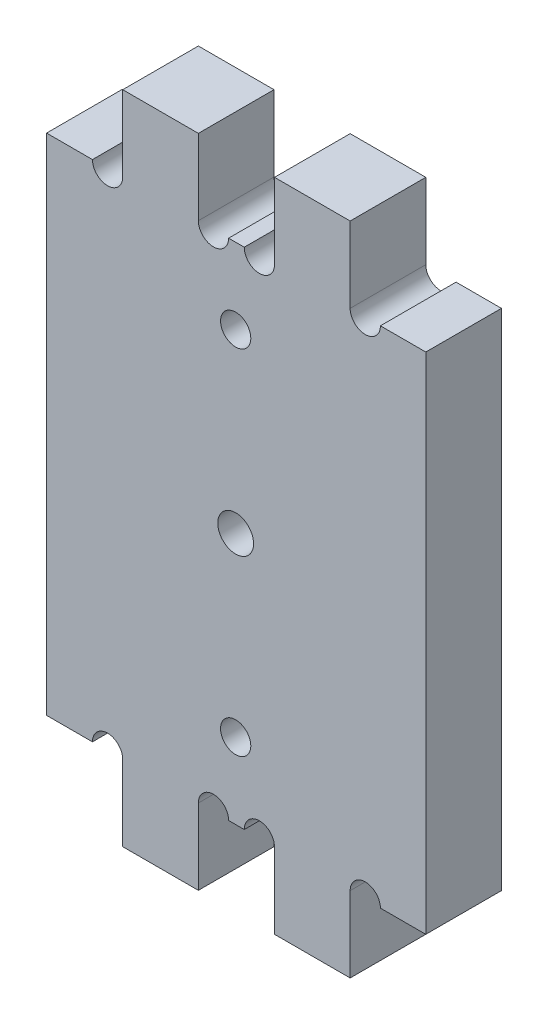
ISO-10303-21;
HEADER;
FILE_DESCRIPTION(('STEP AP214'),'2;1');
FILE_NAME('part.step','',(''),(''),'','','');
FILE_SCHEMA(('AUTOMOTIVE_DESIGN { 1 0 10303 214 1 1 1 1 }'));
ENDSEC;
DATA;
#1=APPLICATION_CONTEXT('core data for automotive mechanical design processes');
#2=APPLICATION_PROTOCOL_DEFINITION('international standard','automotive_design',2000,#1);
#3=PRODUCT_CONTEXT('',#1,'mechanical');
#4=PRODUCT('Part','Part','',(#3));
#5=PRODUCT_RELATED_PRODUCT_CATEGORY('part','',(#4));
#6=PRODUCT_DEFINITION_FORMATION('','',#4);
#7=PRODUCT_DEFINITION_CONTEXT('part definition',#1,'design');
#8=PRODUCT_DEFINITION('design','',#6,#7);
#9=PRODUCT_DEFINITION_SHAPE('','',#8);
#10=(LENGTH_UNIT() NAMED_UNIT(*) SI_UNIT(.MILLI.,.METRE.));
#11=(NAMED_UNIT(*) PLANE_ANGLE_UNIT() SI_UNIT($,.RADIAN.));
#12=(NAMED_UNIT(*) SI_UNIT($,.STERADIAN.) SOLID_ANGLE_UNIT());
#13=UNCERTAINTY_MEASURE_WITH_UNIT(LENGTH_MEASURE(1.E-05),#10,'distance_accuracy_value','');
#14=(GEOMETRIC_REPRESENTATION_CONTEXT(3) GLOBAL_UNCERTAINTY_ASSIGNED_CONTEXT((#13)) GLOBAL_UNIT_ASSIGNED_CONTEXT((#10,
#11,#12)) REPRESENTATION_CONTEXT('',''));
#15=CARTESIAN_POINT('',(0.,0.,0.));
#16=DIRECTION('',(0.,0.,1.));
#17=DIRECTION('',(1.,0.,0.));
#18=AXIS2_PLACEMENT_3D('',#15,#16,#17);
#19=CARTESIAN_POINT('',(0.,0.,15.));
#20=DIRECTION('',(0.,1.,0.));
#21=DIRECTION('',(-1.,0.,0.));
#22=AXIS2_PLACEMENT_3D('',#19,#20,#21);
#23=PLANE('',#22);
#24=DIRECTION('',(1.,0.,0.));
#25=VECTOR('',#24,1.);
#26=CARTESIAN_POINT('',(0.,0.,0.));
#27=LINE('',#26,#25);
#28=CARTESIAN_POINT('',(-8.99999999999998,0.,0.));
#29=VERTEX_POINT('',#28);
#30=CARTESIAN_POINT('',(0.,0.,0.));
#31=VERTEX_POINT('',#30);
#32=EDGE_CURVE('E255',#29,#31,#27,.T.);
#33=ORIENTED_EDGE('',*,*,#32,.T.);
#34=DIRECTION('',(0.,0.,-1.));
#35=VECTOR('',#34,1.);
#36=CARTESIAN_POINT('',(0.,0.,15.));
#37=LINE('',#36,#35);
#38=CARTESIAN_POINT('',(0.,0.,15.));
#39=VERTEX_POINT('',#38);
#40=EDGE_CURVE('E11',#39,#31,#37,.T.);
#41=ORIENTED_EDGE('',*,*,#40,.F.);
#42=DIRECTION('',(1.,0.,0.));
#43=VECTOR('',#42,1.);
#44=CARTESIAN_POINT('',(0.,0.,15.));
#45=LINE('',#44,#43);
#46=CARTESIAN_POINT('',(-8.99999999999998,0.,15.));
#47=VERTEX_POINT('',#46);
#48=EDGE_CURVE('E310',#47,#39,#45,.T.);
#49=ORIENTED_EDGE('',*,*,#48,.F.);
#50=DIRECTION('',(0.,0.,-1.));
#51=VECTOR('',#50,1.);
#52=CARTESIAN_POINT('',(-8.99999999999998,0.,15.));
#53=LINE('',#52,#51);
#54=EDGE_CURVE('E251',#47,#29,#53,.T.);
#55=ORIENTED_EDGE('',*,*,#54,.T.);
#56=EDGE_LOOP('',(#33,#41,#49,#55));
#57=FACE_BOUND('',#56,.T.);
#58=ADVANCED_FACE('F37',(#57),#23,.F.);
#59=CARTESIAN_POINT('',(0.,0.,15.));
#60=DIRECTION('',(-1.,0.,0.));
#61=DIRECTION('',(0.,0.,1.));
#62=AXIS2_PLACEMENT_3D('',#59,#60,#61);
#63=PLANE('',#62);
#64=DIRECTION('',(0.,1.,0.));
#65=VECTOR('',#64,1.);
#66=CARTESIAN_POINT('',(0.,0.,0.));
#67=LINE('',#66,#65);
#68=CARTESIAN_POINT('',(0.,100.,0.));
#69=VERTEX_POINT('',#68);
#70=EDGE_CURVE('E258',#31,#69,#67,.T.);
#71=ORIENTED_EDGE('',*,*,#70,.T.);
#72=DIRECTION('',(0.,0.,-1.));
#73=VECTOR('',#72,1.);
#74=CARTESIAN_POINT('',(0.,100.,15.));
#75=LINE('',#74,#73);
#76=CARTESIAN_POINT('',(0.,100.,15.));
#77=VERTEX_POINT('',#76);
#78=EDGE_CURVE('E46',#77,#69,#75,.T.);
#79=ORIENTED_EDGE('',*,*,#78,.F.);
#80=DIRECTION('',(0.,1.,0.));
#81=VECTOR('',#80,1.);
#82=CARTESIAN_POINT('',(0.,0.,15.));
#83=LINE('',#82,#81);
#84=EDGE_CURVE('E158',#39,#77,#83,.T.);
#85=ORIENTED_EDGE('',*,*,#84,.F.);
#86=ORIENTED_EDGE('',*,*,#40,.T.);
#87=EDGE_LOOP('',(#71,#79,#85,#86));
#88=FACE_BOUND('',#87,.T.);
#89=ADVANCED_FACE('F486',(#88),#63,.F.);
#90=CARTESIAN_POINT('',(0.,100.,15.));
#91=DIRECTION('',(0.,-1.,0.));
#92=DIRECTION('',(0.,0.,-1.));
#93=AXIS2_PLACEMENT_3D('',#90,#91,#92);
#94=PLANE('',#93);
#95=DIRECTION('',(-1.,0.,0.));
#96=VECTOR('',#95,1.);
#97=CARTESIAN_POINT('',(0.,100.,0.));
#98=LINE('',#97,#96);
#99=CARTESIAN_POINT('',(-9.,100.,0.));
#100=VERTEX_POINT('',#99);
#101=EDGE_CURVE('E261',#69,#100,#98,.T.);
#102=ORIENTED_EDGE('',*,*,#101,.T.);
#103=DIRECTION('',(0.,0.,-1.));
#104=VECTOR('',#103,1.);
#105=CARTESIAN_POINT('',(-9.,100.,15.));
#106=LINE('',#105,#104);
#107=CARTESIAN_POINT('',(-9.,100.,15.));
#108=VERTEX_POINT('',#107);
#109=EDGE_CURVE('E377',#108,#100,#106,.T.);
#110=ORIENTED_EDGE('',*,*,#109,.F.);
#111=DIRECTION('',(-1.,0.,0.));
#112=VECTOR('',#111,1.);
#113=CARTESIAN_POINT('',(0.,100.,15.));
#114=LINE('',#113,#112);
#115=EDGE_CURVE('E414',#77,#108,#114,.T.);
#116=ORIENTED_EDGE('',*,*,#115,.F.);
#117=ORIENTED_EDGE('',*,*,#78,.T.);
#118=EDGE_LOOP('',(#102,#110,#116,#117));
#119=FACE_BOUND('',#118,.T.);
#120=ADVANCED_FACE('F490',(#119),#94,.F.);
#121=CARTESIAN_POINT('',(-12.,100.,15.));
#122=DIRECTION('',(0.,0.,-1.));
#123=DIRECTION('',(-1.,0.,0.));
#124=AXIS2_PLACEMENT_3D('',#121,#122,#123);
#125=CYLINDRICAL_SURFACE('',#124,3.);
#126=CARTESIAN_POINT('',(-12.,100.,0.));
#127=DIRECTION('',(0.,0.,-1.));
#128=DIRECTION('',(-1.,0.,0.));
#129=AXIS2_PLACEMENT_3D('',#126,#127,#128);
#130=CIRCLE('',#129,3.);
#131=CARTESIAN_POINT('',(-15.,100.,0.));
#132=VERTEX_POINT('',#131);
#133=EDGE_CURVE('E263',#100,#132,#130,.T.);
#134=ORIENTED_EDGE('',*,*,#133,.T.);
#135=DIRECTION('',(0.,0.,-1.));
#136=VECTOR('',#135,1.);
#137=CARTESIAN_POINT('',(-15.,100.,15.));
#138=LINE('',#137,#136);
#139=CARTESIAN_POINT('',(-15.,100.,15.));
#140=VERTEX_POINT('',#139);
#141=EDGE_CURVE('E374',#140,#132,#138,.T.);
#142=ORIENTED_EDGE('',*,*,#141,.F.);
#143=CARTESIAN_POINT('',(-12.,100.,15.));
#144=DIRECTION('',(0.,0.,-1.));
#145=DIRECTION('',(-1.,0.,0.));
#146=AXIS2_PLACEMENT_3D('',#143,#144,#145);
#147=CIRCLE('',#146,3.);
#148=EDGE_CURVE('E416',#108,#140,#147,.T.);
#149=ORIENTED_EDGE('',*,*,#148,.F.);
#150=ORIENTED_EDGE('',*,*,#109,.T.);
#151=EDGE_LOOP('',(#134,#142,#149,#150));
#152=FACE_BOUND('',#151,.T.);
#153=ADVANCED_FACE('F494',(#152),#125,.F.);
#154=CARTESIAN_POINT('',(-15.,100.,15.));
#155=DIRECTION('',(-1.,0.,0.));
#156=DIRECTION('',(0.,-1.,0.));
#157=AXIS2_PLACEMENT_3D('',#154,#155,#156);
#158=PLANE('',#157);
#159=DIRECTION('',(0.,1.,0.));
#160=VECTOR('',#159,1.);
#161=CARTESIAN_POINT('',(-15.,100.,0.));
#162=LINE('',#161,#160);
#163=CARTESIAN_POINT('',(-15.,115.,0.));
#164=VERTEX_POINT('',#163);
#165=EDGE_CURVE('E265',#132,#164,#162,.T.);
#166=ORIENTED_EDGE('',*,*,#165,.T.);
#167=DIRECTION('',(0.,0.,-1.));
#168=VECTOR('',#167,1.);
#169=CARTESIAN_POINT('',(-15.,115.,15.));
#170=LINE('',#169,#168);
#171=CARTESIAN_POINT('',(-15.,115.,15.));
#172=VERTEX_POINT('',#171);
#173=EDGE_CURVE('E371',#172,#164,#170,.T.);
#174=ORIENTED_EDGE('',*,*,#173,.F.);
#175=DIRECTION('',(0.,1.,0.));
#176=VECTOR('',#175,1.);
#177=CARTESIAN_POINT('',(-15.,100.,15.));
#178=LINE('',#177,#176);
#179=EDGE_CURVE('E418',#140,#172,#178,.T.);
#180=ORIENTED_EDGE('',*,*,#179,.F.);
#181=ORIENTED_EDGE('',*,*,#141,.T.);
#182=EDGE_LOOP('',(#166,#174,#180,#181));
#183=FACE_BOUND('',#182,.T.);
#184=ADVANCED_FACE('F500',(#183),#158,.F.);
#185=CARTESIAN_POINT('',(-15.,115.,15.));
#186=DIRECTION('',(0.,-1.,0.));
#187=DIRECTION('',(0.,0.,-1.));
#188=AXIS2_PLACEMENT_3D('',#185,#186,#187);
#189=PLANE('',#188);
#190=DIRECTION('',(-1.,0.,0.));
#191=VECTOR('',#190,1.);
#192=CARTESIAN_POINT('',(-15.,115.,0.));
#193=LINE('',#192,#191);
#194=CARTESIAN_POINT('',(-30.,115.,0.));
#195=VERTEX_POINT('',#194);
#196=EDGE_CURVE('E267',#164,#195,#193,.T.);
#197=ORIENTED_EDGE('',*,*,#196,.T.);
#198=DIRECTION('',(0.,0.,-1.));
#199=VECTOR('',#198,1.);
#200=CARTESIAN_POINT('',(-30.,115.,15.));
#201=LINE('',#200,#199);
#202=CARTESIAN_POINT('',(-30.,115.,15.));
#203=VERTEX_POINT('',#202);
#204=EDGE_CURVE('E368',#203,#195,#201,.T.);
#205=ORIENTED_EDGE('',*,*,#204,.F.);
#206=DIRECTION('',(-1.,0.,0.));
#207=VECTOR('',#206,1.);
#208=CARTESIAN_POINT('',(-15.,115.,15.));
#209=LINE('',#208,#207);
#210=EDGE_CURVE('E420',#172,#203,#209,.T.);
#211=ORIENTED_EDGE('',*,*,#210,.F.);
#212=ORIENTED_EDGE('',*,*,#173,.T.);
#213=EDGE_LOOP('',(#197,#205,#211,#212));
#214=FACE_BOUND('',#213,.T.);
#215=ADVANCED_FACE('F504',(#214),#189,.F.);
#216=CARTESIAN_POINT('',(-30.,115.,15.));
#217=DIRECTION('',(1.,0.,0.));
#218=DIRECTION('',(0.,1.,0.));
#219=AXIS2_PLACEMENT_3D('',#216,#217,#218);
#220=PLANE('',#219);
#221=DIRECTION('',(0.,-1.,0.));
#222=VECTOR('',#221,1.);
#223=CARTESIAN_POINT('',(-30.,115.,0.));
#224=LINE('',#223,#222);
#225=CARTESIAN_POINT('',(-30.,100.,0.));
#226=VERTEX_POINT('',#225);
#227=EDGE_CURVE('E269',#195,#226,#224,.T.);
#228=ORIENTED_EDGE('',*,*,#227,.T.);
#229=DIRECTION('',(0.,0.,-1.));
#230=VECTOR('',#229,1.);
#231=CARTESIAN_POINT('',(-30.,100.,15.));
#232=LINE('',#231,#230);
#233=CARTESIAN_POINT('',(-30.,100.,15.));
#234=VERTEX_POINT('',#233);
#235=EDGE_CURVE('E365',#234,#226,#232,.T.);
#236=ORIENTED_EDGE('',*,*,#235,.F.);
#237=DIRECTION('',(0.,-1.,0.));
#238=VECTOR('',#237,1.);
#239=CARTESIAN_POINT('',(-30.,115.,15.));
#240=LINE('',#239,#238);
#241=EDGE_CURVE('E422',#203,#234,#240,.T.);
#242=ORIENTED_EDGE('',*,*,#241,.F.);
#243=ORIENTED_EDGE('',*,*,#204,.T.);
#244=EDGE_LOOP('',(#228,#236,#242,#243));
#245=FACE_BOUND('',#244,.T.);
#246=ADVANCED_FACE('F508',(#245),#220,.F.);
#247=CARTESIAN_POINT('',(-33.,100.,15.));
#248=DIRECTION('',(0.,0.,-1.));
#249=DIRECTION('',(-1.,0.,0.));
#250=AXIS2_PLACEMENT_3D('',#247,#248,#249);
#251=CYLINDRICAL_SURFACE('',#250,3.);
#252=CARTESIAN_POINT('',(-33.,100.,0.));
#253=DIRECTION('',(0.,0.,-1.));
#254=DIRECTION('',(-1.,0.,0.));
#255=AXIS2_PLACEMENT_3D('',#252,#253,#254);
#256=CIRCLE('',#255,3.);
#257=CARTESIAN_POINT('',(-36.,100.,0.));
#258=VERTEX_POINT('',#257);
#259=EDGE_CURVE('E271',#226,#258,#256,.T.);
#260=ORIENTED_EDGE('',*,*,#259,.T.);
#261=DIRECTION('',(0.,0.,-1.));
#262=VECTOR('',#261,1.);
#263=CARTESIAN_POINT('',(-36.,100.,15.));
#264=LINE('',#263,#262);
#265=CARTESIAN_POINT('',(-36.,100.,15.));
#266=VERTEX_POINT('',#265);
#267=EDGE_CURVE('E362',#266,#258,#264,.T.);
#268=ORIENTED_EDGE('',*,*,#267,.F.);
#269=CARTESIAN_POINT('',(-33.,100.,15.));
#270=DIRECTION('',(0.,0.,-1.));
#271=DIRECTION('',(-1.,0.,0.));
#272=AXIS2_PLACEMENT_3D('',#269,#270,#271);
#273=CIRCLE('',#272,3.);
#274=EDGE_CURVE('E424',#234,#266,#273,.T.);
#275=ORIENTED_EDGE('',*,*,#274,.F.);
#276=ORIENTED_EDGE('',*,*,#235,.T.);
#277=EDGE_LOOP('',(#260,#268,#275,#276));
#278=FACE_BOUND('',#277,.T.);
#279=ADVANCED_FACE('F512',(#278),#251,.F.);
#280=CARTESIAN_POINT('',(-36.,100.,15.));
#281=DIRECTION('',(0.,-1.,0.));
#282=DIRECTION('',(0.,0.,-1.));
#283=AXIS2_PLACEMENT_3D('',#280,#281,#282);
#284=PLANE('',#283);
#285=DIRECTION('',(-1.,0.,0.));
#286=VECTOR('',#285,1.);
#287=CARTESIAN_POINT('',(-36.,100.,0.));
#288=LINE('',#287,#286);
#289=CARTESIAN_POINT('',(-39.1,100.,0.));
#290=VERTEX_POINT('',#289);
#291=EDGE_CURVE('E273',#258,#290,#288,.T.);
#292=ORIENTED_EDGE('',*,*,#291,.T.);
#293=DIRECTION('',(0.,0.,-1.));
#294=VECTOR('',#293,1.);
#295=CARTESIAN_POINT('',(-39.1,100.,15.));
#296=LINE('',#295,#294);
#297=CARTESIAN_POINT('',(-39.1,100.,15.));
#298=VERTEX_POINT('',#297);
#299=EDGE_CURVE('E359',#298,#290,#296,.T.);
#300=ORIENTED_EDGE('',*,*,#299,.F.);
#301=DIRECTION('',(-1.,0.,0.));
#302=VECTOR('',#301,1.);
#303=CARTESIAN_POINT('',(-36.,100.,15.));
#304=LINE('',#303,#302);
#305=EDGE_CURVE('E426',#266,#298,#304,.T.);
#306=ORIENTED_EDGE('',*,*,#305,.F.);
#307=ORIENTED_EDGE('',*,*,#267,.T.);
#308=EDGE_LOOP('',(#292,#300,#306,#307));
#309=FACE_BOUND('',#308,.T.);
#310=ADVANCED_FACE('F516',(#309),#284,.F.);
#311=CARTESIAN_POINT('',(-42.1,100.,15.));
#312=DIRECTION('',(0.,0.,-1.));
#313=DIRECTION('',(-1.,0.,0.));
#314=AXIS2_PLACEMENT_3D('',#311,#312,#313);
#315=CYLINDRICAL_SURFACE('',#314,2.99999999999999);
#316=CARTESIAN_POINT('',(-42.1,100.,0.));
#317=DIRECTION('',(0.,0.,-1.));
#318=DIRECTION('',(-1.,0.,0.));
#319=AXIS2_PLACEMENT_3D('',#316,#317,#318);
#320=CIRCLE('',#319,2.99999999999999);
#321=CARTESIAN_POINT('',(-45.1,100.,0.));
#322=VERTEX_POINT('',#321);
#323=EDGE_CURVE('E275',#290,#322,#320,.T.);
#324=ORIENTED_EDGE('',*,*,#323,.T.);
#325=DIRECTION('',(0.,0.,-1.));
#326=VECTOR('',#325,1.);
#327=CARTESIAN_POINT('',(-45.1,100.,15.));
#328=LINE('',#327,#326);
#329=CARTESIAN_POINT('',(-45.1,100.,15.));
#330=VERTEX_POINT('',#329);
#331=EDGE_CURVE('E356',#330,#322,#328,.T.);
#332=ORIENTED_EDGE('',*,*,#331,.F.);
#333=CARTESIAN_POINT('',(-42.1,100.,15.));
#334=DIRECTION('',(0.,0.,-1.));
#335=DIRECTION('',(-1.,0.,0.));
#336=AXIS2_PLACEMENT_3D('',#333,#334,#335);
#337=CIRCLE('',#336,2.99999999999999);
#338=EDGE_CURVE('E428',#298,#330,#337,.T.);
#339=ORIENTED_EDGE('',*,*,#338,.F.);
#340=ORIENTED_EDGE('',*,*,#299,.T.);
#341=EDGE_LOOP('',(#324,#332,#339,#340));
#342=FACE_BOUND('',#341,.T.);
#343=ADVANCED_FACE('F520',(#342),#315,.F.);
#344=CARTESIAN_POINT('',(-45.1,100.,15.));
#345=DIRECTION('',(-1.,0.,0.));
#346=DIRECTION('',(0.,-1.,0.));
#347=AXIS2_PLACEMENT_3D('',#344,#345,#346);
#348=PLANE('',#347);
#349=DIRECTION('',(0.,1.,0.));
#350=VECTOR('',#349,1.);
#351=CARTESIAN_POINT('',(-45.1,100.,0.));
#352=LINE('',#351,#350);
#353=CARTESIAN_POINT('',(-45.1,115.,0.));
#354=VERTEX_POINT('',#353);
#355=EDGE_CURVE('E277',#322,#354,#352,.T.);
#356=ORIENTED_EDGE('',*,*,#355,.T.);
#357=DIRECTION('',(0.,0.,-1.));
#358=VECTOR('',#357,1.);
#359=CARTESIAN_POINT('',(-45.1,115.,15.));
#360=LINE('',#359,#358);
#361=CARTESIAN_POINT('',(-45.1,115.,15.));
#362=VERTEX_POINT('',#361);
#363=EDGE_CURVE('E353',#362,#354,#360,.T.);
#364=ORIENTED_EDGE('',*,*,#363,.F.);
#365=DIRECTION('',(0.,1.,0.));
#366=VECTOR('',#365,1.);
#367=CARTESIAN_POINT('',(-45.1,100.,15.));
#368=LINE('',#367,#366);
#369=EDGE_CURVE('E430',#330,#362,#368,.T.);
#370=ORIENTED_EDGE('',*,*,#369,.F.);
#371=ORIENTED_EDGE('',*,*,#331,.T.);
#372=EDGE_LOOP('',(#356,#364,#370,#371));
#373=FACE_BOUND('',#372,.T.);
#374=ADVANCED_FACE('F524',(#373),#348,.F.);
#375=CARTESIAN_POINT('',(-45.1,115.,15.));
#376=DIRECTION('',(0.,-1.,0.));
#377=DIRECTION('',(0.,0.,-1.));
#378=AXIS2_PLACEMENT_3D('',#375,#376,#377);
#379=PLANE('',#378);
#380=DIRECTION('',(-1.,0.,0.));
#381=VECTOR('',#380,1.);
#382=CARTESIAN_POINT('',(-45.1,115.,0.));
#383=LINE('',#382,#381);
#384=CARTESIAN_POINT('',(-60.1,115.,0.));
#385=VERTEX_POINT('',#384);
#386=EDGE_CURVE('E279',#354,#385,#383,.T.);
#387=ORIENTED_EDGE('',*,*,#386,.T.);
#388=DIRECTION('',(0.,0.,-1.));
#389=VECTOR('',#388,1.);
#390=CARTESIAN_POINT('',(-60.1,115.,15.));
#391=LINE('',#390,#389);
#392=CARTESIAN_POINT('',(-60.1,115.,15.));
#393=VERTEX_POINT('',#392);
#394=EDGE_CURVE('E350',#393,#385,#391,.T.);
#395=ORIENTED_EDGE('',*,*,#394,.F.);
#396=DIRECTION('',(-1.,0.,0.));
#397=VECTOR('',#396,1.);
#398=CARTESIAN_POINT('',(-45.1,115.,15.));
#399=LINE('',#398,#397);
#400=EDGE_CURVE('E432',#362,#393,#399,.T.);
#401=ORIENTED_EDGE('',*,*,#400,.F.);
#402=ORIENTED_EDGE('',*,*,#363,.T.);
#403=EDGE_LOOP('',(#387,#395,#401,#402));
#404=FACE_BOUND('',#403,.T.);
#405=ADVANCED_FACE('F528',(#404),#379,.F.);
#406=CARTESIAN_POINT('',(-60.1,115.,15.));
#407=DIRECTION('',(1.,0.,0.));
#408=DIRECTION('',(0.,1.,0.));
#409=AXIS2_PLACEMENT_3D('',#406,#407,#408);
#410=PLANE('',#409);
#411=DIRECTION('',(0.,-1.,0.));
#412=VECTOR('',#411,1.);
#413=CARTESIAN_POINT('',(-60.1,115.,0.));
#414=LINE('',#413,#412);
#415=CARTESIAN_POINT('',(-60.1,100.,0.));
#416=VERTEX_POINT('',#415);
#417=EDGE_CURVE('E281',#385,#416,#414,.T.);
#418=ORIENTED_EDGE('',*,*,#417,.T.);
#419=DIRECTION('',(0.,0.,-1.));
#420=VECTOR('',#419,1.);
#421=CARTESIAN_POINT('',(-60.1,100.,15.));
#422=LINE('',#421,#420);
#423=CARTESIAN_POINT('',(-60.1,100.,15.));
#424=VERTEX_POINT('',#423);
#425=EDGE_CURVE('E347',#424,#416,#422,.T.);
#426=ORIENTED_EDGE('',*,*,#425,.F.);
#427=DIRECTION('',(0.,-1.,0.));
#428=VECTOR('',#427,1.);
#429=CARTESIAN_POINT('',(-60.1,115.,15.));
#430=LINE('',#429,#428);
#431=EDGE_CURVE('E434',#393,#424,#430,.T.);
#432=ORIENTED_EDGE('',*,*,#431,.F.);
#433=ORIENTED_EDGE('',*,*,#394,.T.);
#434=EDGE_LOOP('',(#418,#426,#432,#433));
#435=FACE_BOUND('',#434,.T.);
#436=ADVANCED_FACE('F532',(#435),#410,.F.);
#437=CARTESIAN_POINT('',(-63.1,100.,15.));
#438=DIRECTION('',(0.,0.,-1.));
#439=DIRECTION('',(-1.,0.,0.));
#440=AXIS2_PLACEMENT_3D('',#437,#438,#439);
#441=CYLINDRICAL_SURFACE('',#440,3.);
#442=CARTESIAN_POINT('',(-63.1,100.,0.));
#443=DIRECTION('',(0.,0.,-1.));
#444=DIRECTION('',(-1.,0.,0.));
#445=AXIS2_PLACEMENT_3D('',#442,#443,#444);
#446=CIRCLE('',#445,3.);
#447=CARTESIAN_POINT('',(-66.1,100.,0.));
#448=VERTEX_POINT('',#447);
#449=EDGE_CURVE('E283',#416,#448,#446,.T.);
#450=ORIENTED_EDGE('',*,*,#449,.T.);
#451=DIRECTION('',(0.,0.,-1.));
#452=VECTOR('',#451,1.);
#453=CARTESIAN_POINT('',(-66.1,100.,15.));
#454=LINE('',#453,#452);
#455=CARTESIAN_POINT('',(-66.1,100.,15.));
#456=VERTEX_POINT('',#455);
#457=EDGE_CURVE('E344',#456,#448,#454,.T.);
#458=ORIENTED_EDGE('',*,*,#457,.F.);
#459=CARTESIAN_POINT('',(-63.1,100.,15.));
#460=DIRECTION('',(0.,0.,-1.));
#461=DIRECTION('',(-1.,0.,0.));
#462=AXIS2_PLACEMENT_3D('',#459,#460,#461);
#463=CIRCLE('',#462,3.);
#464=EDGE_CURVE('E436',#424,#456,#463,.T.);
#465=ORIENTED_EDGE('',*,*,#464,.F.);
#466=ORIENTED_EDGE('',*,*,#425,.T.);
#467=EDGE_LOOP('',(#450,#458,#465,#466));
#468=FACE_BOUND('',#467,.T.);
#469=ADVANCED_FACE('F536',(#468),#441,.F.);
#470=CARTESIAN_POINT('',(-66.1,100.,15.));
#471=DIRECTION('',(0.,-1.,0.));
#472=DIRECTION('',(1.,0.,0.));
#473=AXIS2_PLACEMENT_3D('',#470,#471,#472);
#474=PLANE('',#473);
#475=DIRECTION('',(-1.,0.,0.));
#476=VECTOR('',#475,1.);
#477=CARTESIAN_POINT('',(-66.1,100.,0.));
#478=LINE('',#477,#476);
#479=CARTESIAN_POINT('',(-75.2,100.,0.));
#480=VERTEX_POINT('',#479);
#481=EDGE_CURVE('E285',#448,#480,#478,.T.);
#482=ORIENTED_EDGE('',*,*,#481,.T.);
#483=DIRECTION('',(0.,0.,-1.));
#484=VECTOR('',#483,1.);
#485=CARTESIAN_POINT('',(-75.2,100.,15.));
#486=LINE('',#485,#484);
#487=CARTESIAN_POINT('',(-75.2,100.,15.));
#488=VERTEX_POINT('',#487);
#489=EDGE_CURVE('E341',#488,#480,#486,.T.);
#490=ORIENTED_EDGE('',*,*,#489,.F.);
#491=DIRECTION('',(-1.,0.,0.));
#492=VECTOR('',#491,1.);
#493=CARTESIAN_POINT('',(-66.1,100.,15.));
#494=LINE('',#493,#492);
#495=EDGE_CURVE('E438',#456,#488,#494,.T.);
#496=ORIENTED_EDGE('',*,*,#495,.F.);
#497=ORIENTED_EDGE('',*,*,#457,.T.);
#498=EDGE_LOOP('',(#482,#490,#496,#497));
#499=FACE_BOUND('',#498,.T.);
#500=ADVANCED_FACE('F540',(#499),#474,.F.);
#501=CARTESIAN_POINT('',(-75.2,100.,15.));
#502=DIRECTION('',(1.,0.,0.));
#503=DIRECTION('',(0.,1.,0.));
#504=AXIS2_PLACEMENT_3D('',#501,#502,#503);
#505=PLANE('',#504);
#506=DIRECTION('',(0.,-1.,0.));
#507=VECTOR('',#506,1.);
#508=CARTESIAN_POINT('',(-75.2,100.,0.));
#509=LINE('',#508,#507);
#510=CARTESIAN_POINT('',(-75.2,0.,0.));
#511=VERTEX_POINT('',#510);
#512=EDGE_CURVE('E287',#480,#511,#509,.T.);
#513=ORIENTED_EDGE('',*,*,#512,.T.);
#514=DIRECTION('',(0.,0.,-1.));
#515=VECTOR('',#514,1.);
#516=CARTESIAN_POINT('',(-75.2,0.,15.));
#517=LINE('',#516,#515);
#518=CARTESIAN_POINT('',(-75.2,0.,15.));
#519=VERTEX_POINT('',#518);
#520=EDGE_CURVE('E338',#519,#511,#517,.T.);
#521=ORIENTED_EDGE('',*,*,#520,.F.);
#522=DIRECTION('',(0.,-1.,0.));
#523=VECTOR('',#522,1.);
#524=CARTESIAN_POINT('',(-75.2,100.,15.));
#525=LINE('',#524,#523);
#526=EDGE_CURVE('E440',#488,#519,#525,.T.);
#527=ORIENTED_EDGE('',*,*,#526,.F.);
#528=ORIENTED_EDGE('',*,*,#489,.T.);
#529=EDGE_LOOP('',(#513,#521,#527,#528));
#530=FACE_BOUND('',#529,.T.);
#531=ADVANCED_FACE('F544',(#530),#505,.F.);
#532=CARTESIAN_POINT('',(-75.2,0.,15.));
#533=DIRECTION('',(0.,1.,0.));
#534=DIRECTION('',(0.,0.,1.));
#535=AXIS2_PLACEMENT_3D('',#532,#533,#534);
#536=PLANE('',#535);
#537=DIRECTION('',(1.,0.,0.));
#538=VECTOR('',#537,1.);
#539=CARTESIAN_POINT('',(-75.2,0.,0.));
#540=LINE('',#539,#538);
#541=CARTESIAN_POINT('',(-66.1,0.,0.));
#542=VERTEX_POINT('',#541);
#543=EDGE_CURVE('E289',#511,#542,#540,.T.);
#544=ORIENTED_EDGE('',*,*,#543,.T.);
#545=DIRECTION('',(0.,0.,-1.));
#546=VECTOR('',#545,1.);
#547=CARTESIAN_POINT('',(-66.1,0.,15.));
#548=LINE('',#547,#546);
#549=CARTESIAN_POINT('',(-66.1,0.,15.));
#550=VERTEX_POINT('',#549);
#551=EDGE_CURVE('E335',#550,#542,#548,.T.);
#552=ORIENTED_EDGE('',*,*,#551,.F.);
#553=DIRECTION('',(1.,0.,0.));
#554=VECTOR('',#553,1.);
#555=CARTESIAN_POINT('',(-75.2,0.,15.));
#556=LINE('',#555,#554);
#557=EDGE_CURVE('E442',#519,#550,#556,.T.);
#558=ORIENTED_EDGE('',*,*,#557,.F.);
#559=ORIENTED_EDGE('',*,*,#520,.T.);
#560=EDGE_LOOP('',(#544,#552,#558,#559));
#561=FACE_BOUND('',#560,.T.);
#562=ADVANCED_FACE('F548',(#561),#536,.F.);
#563=CARTESIAN_POINT('',(-63.1,0.,15.));
#564=DIRECTION('',(0.,0.,-1.));
#565=DIRECTION('',(-1.,0.,0.));
#566=AXIS2_PLACEMENT_3D('',#563,#564,#565);
#567=CYLINDRICAL_SURFACE('',#566,3.);
#568=CARTESIAN_POINT('',(-63.1,0.,0.));
#569=DIRECTION('',(0.,0.,-1.));
#570=DIRECTION('',(1.,0.,0.));
#571=AXIS2_PLACEMENT_3D('',#568,#569,#570);
#572=CIRCLE('',#571,3.);
#573=CARTESIAN_POINT('',(-60.1,0.,0.));
#574=VERTEX_POINT('',#573);
#575=EDGE_CURVE('E291',#542,#574,#572,.T.);
#576=ORIENTED_EDGE('',*,*,#575,.T.);
#577=DIRECTION('',(0.,0.,-1.));
#578=VECTOR('',#577,1.);
#579=CARTESIAN_POINT('',(-60.1,0.,15.));
#580=LINE('',#579,#578);
#581=CARTESIAN_POINT('',(-60.1,0.,15.));
#582=VERTEX_POINT('',#581);
#583=EDGE_CURVE('E332',#582,#574,#580,.T.);
#584=ORIENTED_EDGE('',*,*,#583,.F.);
#585=CARTESIAN_POINT('',(-63.1,0.,15.));
#586=DIRECTION('',(0.,0.,-1.));
#587=DIRECTION('',(1.,0.,0.));
#588=AXIS2_PLACEMENT_3D('',#585,#586,#587);
#589=CIRCLE('',#588,3.);
#590=EDGE_CURVE('E444',#550,#582,#589,.T.);
#591=ORIENTED_EDGE('',*,*,#590,.F.);
#592=ORIENTED_EDGE('',*,*,#551,.T.);
#593=EDGE_LOOP('',(#576,#584,#591,#592));
#594=FACE_BOUND('',#593,.T.);
#595=ADVANCED_FACE('F552',(#594),#567,.F.);
#596=CARTESIAN_POINT('',(-60.1,0.,15.));
#597=DIRECTION('',(1.,0.,0.));
#598=DIRECTION('',(0.,1.,0.));
#599=AXIS2_PLACEMENT_3D('',#596,#597,#598);
#600=PLANE('',#599);
#601=DIRECTION('',(0.,-1.,0.));
#602=VECTOR('',#601,1.);
#603=CARTESIAN_POINT('',(-60.1,0.,0.));
#604=LINE('',#603,#602);
#605=CARTESIAN_POINT('',(-60.1,-15.,0.));
#606=VERTEX_POINT('',#605);
#607=EDGE_CURVE('E293',#574,#606,#604,.T.);
#608=ORIENTED_EDGE('',*,*,#607,.T.);
#609=DIRECTION('',(0.,0.,-1.));
#610=VECTOR('',#609,1.);
#611=CARTESIAN_POINT('',(-60.1,-15.,15.));
#612=LINE('',#611,#610);
#613=CARTESIAN_POINT('',(-60.1,-15.,15.));
#614=VERTEX_POINT('',#613);
#615=EDGE_CURVE('E329',#614,#606,#612,.T.);
#616=ORIENTED_EDGE('',*,*,#615,.F.);
#617=DIRECTION('',(0.,-1.,0.));
#618=VECTOR('',#617,1.);
#619=CARTESIAN_POINT('',(-60.1,0.,15.));
#620=LINE('',#619,#618);
#621=EDGE_CURVE('E446',#582,#614,#620,.T.);
#622=ORIENTED_EDGE('',*,*,#621,.F.);
#623=ORIENTED_EDGE('',*,*,#583,.T.);
#624=EDGE_LOOP('',(#608,#616,#622,#623));
#625=FACE_BOUND('',#624,.T.);
#626=ADVANCED_FACE('F556',(#625),#600,.F.);
#627=CARTESIAN_POINT('',(-60.1,-15.,15.));
#628=DIRECTION('',(0.,1.,0.));
#629=DIRECTION('',(0.,0.,1.));
#630=AXIS2_PLACEMENT_3D('',#627,#628,#629);
#631=PLANE('',#630);
#632=DIRECTION('',(1.,0.,0.));
#633=VECTOR('',#632,1.);
#634=CARTESIAN_POINT('',(-60.1,-15.,0.));
#635=LINE('',#634,#633);
#636=CARTESIAN_POINT('',(-45.1,-15.,0.));
#637=VERTEX_POINT('',#636);
#638=EDGE_CURVE('E295',#606,#637,#635,.T.);
#639=ORIENTED_EDGE('',*,*,#638,.T.);
#640=DIRECTION('',(0.,0.,-1.));
#641=VECTOR('',#640,1.);
#642=CARTESIAN_POINT('',(-45.1,-15.,15.));
#643=LINE('',#642,#641);
#644=CARTESIAN_POINT('',(-45.1,-15.,15.));
#645=VERTEX_POINT('',#644);
#646=EDGE_CURVE('E326',#645,#637,#643,.T.);
#647=ORIENTED_EDGE('',*,*,#646,.F.);
#648=DIRECTION('',(1.,0.,0.));
#649=VECTOR('',#648,1.);
#650=CARTESIAN_POINT('',(-60.1,-15.,15.));
#651=LINE('',#650,#649);
#652=EDGE_CURVE('E448',#614,#645,#651,.T.);
#653=ORIENTED_EDGE('',*,*,#652,.F.);
#654=ORIENTED_EDGE('',*,*,#615,.T.);
#655=EDGE_LOOP('',(#639,#647,#653,#654));
#656=FACE_BOUND('',#655,.T.);
#657=ADVANCED_FACE('F560',(#656),#631,.F.);
#658=CARTESIAN_POINT('',(-45.1,-15.,15.));
#659=DIRECTION('',(-1.,0.,0.));
#660=DIRECTION('',(0.,0.,1.));
#661=AXIS2_PLACEMENT_3D('',#658,#659,#660);
#662=PLANE('',#661);
#663=DIRECTION('',(0.,1.,0.));
#664=VECTOR('',#663,1.);
#665=CARTESIAN_POINT('',(-45.1,-15.,0.));
#666=LINE('',#665,#664);
#667=CARTESIAN_POINT('',(-45.1,0.,0.));
#668=VERTEX_POINT('',#667);
#669=EDGE_CURVE('E297',#637,#668,#666,.T.);
#670=ORIENTED_EDGE('',*,*,#669,.T.);
#671=DIRECTION('',(0.,0.,-1.));
#672=VECTOR('',#671,1.);
#673=CARTESIAN_POINT('',(-45.1,0.,15.));
#674=LINE('',#673,#672);
#675=CARTESIAN_POINT('',(-45.1,0.,15.));
#676=VERTEX_POINT('',#675);
#677=EDGE_CURVE('E323',#676,#668,#674,.T.);
#678=ORIENTED_EDGE('',*,*,#677,.F.);
#679=DIRECTION('',(0.,1.,0.));
#680=VECTOR('',#679,1.);
#681=CARTESIAN_POINT('',(-45.1,-15.,15.));
#682=LINE('',#681,#680);
#683=EDGE_CURVE('E450',#645,#676,#682,.T.);
#684=ORIENTED_EDGE('',*,*,#683,.F.);
#685=ORIENTED_EDGE('',*,*,#646,.T.);
#686=EDGE_LOOP('',(#670,#678,#684,#685));
#687=FACE_BOUND('',#686,.T.);
#688=ADVANCED_FACE('F564',(#687),#662,.F.);
#689=CARTESIAN_POINT('',(-42.1,0.,15.));
#690=DIRECTION('',(0.,0.,-1.));
#691=DIRECTION('',(-1.,0.,0.));
#692=AXIS2_PLACEMENT_3D('',#689,#690,#691);
#693=CYLINDRICAL_SURFACE('',#692,3.);
#694=CARTESIAN_POINT('',(-42.1,0.,0.));
#695=DIRECTION('',(0.,0.,-1.));
#696=DIRECTION('',(1.,0.,0.));
#697=AXIS2_PLACEMENT_3D('',#694,#695,#696);
#698=CIRCLE('',#697,3.);
#699=CARTESIAN_POINT('',(-39.1,0.,0.));
#700=VERTEX_POINT('',#699);
#701=EDGE_CURVE('E299',#668,#700,#698,.T.);
#702=ORIENTED_EDGE('',*,*,#701,.T.);
#703=DIRECTION('',(0.,0.,-1.));
#704=VECTOR('',#703,1.);
#705=CARTESIAN_POINT('',(-39.1,0.,15.));
#706=LINE('',#705,#704);
#707=CARTESIAN_POINT('',(-39.1,0.,15.));
#708=VERTEX_POINT('',#707);
#709=EDGE_CURVE('E320',#708,#700,#706,.T.);
#710=ORIENTED_EDGE('',*,*,#709,.F.);
#711=CARTESIAN_POINT('',(-42.1,0.,15.));
#712=DIRECTION('',(0.,0.,-1.));
#713=DIRECTION('',(1.,0.,0.));
#714=AXIS2_PLACEMENT_3D('',#711,#712,#713);
#715=CIRCLE('',#714,3.);
#716=EDGE_CURVE('E452',#676,#708,#715,.T.);
#717=ORIENTED_EDGE('',*,*,#716,.F.);
#718=ORIENTED_EDGE('',*,*,#677,.T.);
#719=EDGE_LOOP('',(#702,#710,#717,#718));
#720=FACE_BOUND('',#719,.T.);
#721=ADVANCED_FACE('F568',(#720),#693,.F.);
#722=CARTESIAN_POINT('',(-36.,0.,15.));
#723=DIRECTION('',(0.,1.,0.));
#724=DIRECTION('',(-1.,0.,0.));
#725=AXIS2_PLACEMENT_3D('',#722,#723,#724);
#726=PLANE('',#725);
#727=DIRECTION('',(1.,0.,0.));
#728=VECTOR('',#727,1.);
#729=CARTESIAN_POINT('',(-36.,0.,0.));
#730=LINE('',#729,#728);
#731=CARTESIAN_POINT('',(-36.,0.,0.));
#732=VERTEX_POINT('',#731);
#733=EDGE_CURVE('E301',#700,#732,#730,.T.);
#734=ORIENTED_EDGE('',*,*,#733,.T.);
#735=DIRECTION('',(0.,0.,-1.));
#736=VECTOR('',#735,1.);
#737=CARTESIAN_POINT('',(-36.,0.,15.));
#738=LINE('',#737,#736);
#739=CARTESIAN_POINT('',(-36.,0.,15.));
#740=VERTEX_POINT('',#739);
#741=EDGE_CURVE('E317',#740,#732,#738,.T.);
#742=ORIENTED_EDGE('',*,*,#741,.F.);
#743=DIRECTION('',(1.,0.,0.));
#744=VECTOR('',#743,1.);
#745=CARTESIAN_POINT('',(-36.,0.,15.));
#746=LINE('',#745,#744);
#747=EDGE_CURVE('E454',#708,#740,#746,.T.);
#748=ORIENTED_EDGE('',*,*,#747,.F.);
#749=ORIENTED_EDGE('',*,*,#709,.T.);
#750=EDGE_LOOP('',(#734,#742,#748,#749));
#751=FACE_BOUND('',#750,.T.);
#752=ADVANCED_FACE('F572',(#751),#726,.F.);
#753=CARTESIAN_POINT('',(-33.,0.,15.));
#754=DIRECTION('',(0.,0.,-1.));
#755=DIRECTION('',(-1.,0.,0.));
#756=AXIS2_PLACEMENT_3D('',#753,#754,#755);
#757=CYLINDRICAL_SURFACE('',#756,3.00000000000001);
#758=CARTESIAN_POINT('',(-33.,0.,0.));
#759=DIRECTION('',(0.,0.,-1.));
#760=DIRECTION('',(-1.,0.,0.));
#761=AXIS2_PLACEMENT_3D('',#758,#759,#760);
#762=CIRCLE('',#761,3.00000000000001);
#763=CARTESIAN_POINT('',(-30.,0.,0.));
#764=VERTEX_POINT('',#763);
#765=EDGE_CURVE('E303',#732,#764,#762,.T.);
#766=ORIENTED_EDGE('',*,*,#765,.T.);
#767=DIRECTION('',(0.,0.,-1.));
#768=VECTOR('',#767,1.);
#769=CARTESIAN_POINT('',(-30.,0.,15.));
#770=LINE('',#769,#768);
#771=CARTESIAN_POINT('',(-30.,0.,15.));
#772=VERTEX_POINT('',#771);
#773=EDGE_CURVE('E314',#772,#764,#770,.T.);
#774=ORIENTED_EDGE('',*,*,#773,.F.);
#775=CARTESIAN_POINT('',(-33.,0.,15.));
#776=DIRECTION('',(0.,0.,-1.));
#777=DIRECTION('',(-1.,0.,0.));
#778=AXIS2_PLACEMENT_3D('',#775,#776,#777);
#779=CIRCLE('',#778,3.00000000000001);
#780=EDGE_CURVE('E456',#740,#772,#779,.T.);
#781=ORIENTED_EDGE('',*,*,#780,.F.);
#782=ORIENTED_EDGE('',*,*,#741,.T.);
#783=EDGE_LOOP('',(#766,#774,#781,#782));
#784=FACE_BOUND('',#783,.T.);
#785=ADVANCED_FACE('F462',(#784),#757,.F.);
#786=CARTESIAN_POINT('',(-30.,0.,15.));
#787=DIRECTION('',(1.,0.,0.));
#788=DIRECTION('',(0.,1.,0.));
#789=AXIS2_PLACEMENT_3D('',#786,#787,#788);
#790=PLANE('',#789);
#791=DIRECTION('',(0.,-1.,0.));
#792=VECTOR('',#791,1.);
#793=CARTESIAN_POINT('',(-30.,0.,0.));
#794=LINE('',#793,#792);
#795=CARTESIAN_POINT('',(-30.,-15.,0.));
#796=VERTEX_POINT('',#795);
#797=EDGE_CURVE('E305',#764,#796,#794,.T.);
#798=ORIENTED_EDGE('',*,*,#797,.T.);
#799=DIRECTION('',(0.,0.,-1.));
#800=VECTOR('',#799,1.);
#801=CARTESIAN_POINT('',(-30.,-15.,15.));
#802=LINE('',#801,#800);
#803=CARTESIAN_POINT('',(-30.,-15.,15.));
#804=VERTEX_POINT('',#803);
#805=EDGE_CURVE('E246',#804,#796,#802,.T.);
#806=ORIENTED_EDGE('',*,*,#805,.F.);
#807=DIRECTION('',(0.,-1.,0.));
#808=VECTOR('',#807,1.);
#809=CARTESIAN_POINT('',(-30.,0.,15.));
#810=LINE('',#809,#808);
#811=EDGE_CURVE('E237',#772,#804,#810,.T.);
#812=ORIENTED_EDGE('',*,*,#811,.F.);
#813=ORIENTED_EDGE('',*,*,#773,.T.);
#814=EDGE_LOOP('',(#798,#806,#812,#813));
#815=FACE_BOUND('',#814,.T.);
#816=ADVANCED_FACE('F466',(#815),#790,.F.);
#817=CARTESIAN_POINT('',(-30.,-15.,15.));
#818=DIRECTION('',(0.,1.,0.));
#819=DIRECTION('',(0.,0.,1.));
#820=AXIS2_PLACEMENT_3D('',#817,#818,#819);
#821=PLANE('',#820);
#822=DIRECTION('',(1.,0.,0.));
#823=VECTOR('',#822,1.);
#824=CARTESIAN_POINT('',(-30.,-15.,0.));
#825=LINE('',#824,#823);
#826=CARTESIAN_POINT('',(-15.,-15.,0.));
#827=VERTEX_POINT('',#826);
#828=EDGE_CURVE('E245',#796,#827,#825,.T.);
#829=ORIENTED_EDGE('',*,*,#828,.T.);
#830=DIRECTION('',(0.,0.,-1.));
#831=VECTOR('',#830,1.);
#832=CARTESIAN_POINT('',(-15.,-15.,15.));
#833=LINE('',#832,#831);
#834=CARTESIAN_POINT('',(-15.,-15.,15.));
#835=VERTEX_POINT('',#834);
#836=EDGE_CURVE('E242',#835,#827,#833,.T.);
#837=ORIENTED_EDGE('',*,*,#836,.F.);
#838=DIRECTION('',(1.,0.,0.));
#839=VECTOR('',#838,1.);
#840=CARTESIAN_POINT('',(-30.,-15.,15.));
#841=LINE('',#840,#839);
#842=EDGE_CURVE('E231',#804,#835,#841,.T.);
#843=ORIENTED_EDGE('',*,*,#842,.F.);
#844=ORIENTED_EDGE('',*,*,#805,.T.);
#845=EDGE_LOOP('',(#829,#837,#843,#844));
#846=FACE_BOUND('',#845,.T.);
#847=ADVANCED_FACE('F243',(#846),#821,.F.);
#848=CARTESIAN_POINT('',(-15.,-15.,15.));
#849=DIRECTION('',(-1.,0.,0.));
#850=DIRECTION('',(0.,-1.,0.));
#851=AXIS2_PLACEMENT_3D('',#848,#849,#850);
#852=PLANE('',#851);
#853=DIRECTION('',(0.,1.,0.));
#854=VECTOR('',#853,1.);
#855=CARTESIAN_POINT('',(-15.,-15.,0.));
#856=LINE('',#855,#854);
#857=CARTESIAN_POINT('',(-15.,0.,0.));
#858=VERTEX_POINT('',#857);
#859=EDGE_CURVE('E144',#827,#858,#856,.T.);
#860=ORIENTED_EDGE('',*,*,#859,.T.);
#861=DIRECTION('',(0.,0.,-1.));
#862=VECTOR('',#861,1.);
#863=CARTESIAN_POINT('',(-15.,0.,15.));
#864=LINE('',#863,#862);
#865=CARTESIAN_POINT('',(-15.,0.,15.));
#866=VERTEX_POINT('',#865);
#867=EDGE_CURVE('E247',#866,#858,#864,.T.);
#868=ORIENTED_EDGE('',*,*,#867,.F.);
#869=DIRECTION('',(0.,1.,0.));
#870=VECTOR('',#869,1.);
#871=CARTESIAN_POINT('',(-15.,-15.,15.));
#872=LINE('',#871,#870);
#873=EDGE_CURVE('E235',#835,#866,#872,.T.);
#874=ORIENTED_EDGE('',*,*,#873,.F.);
#875=ORIENTED_EDGE('',*,*,#836,.T.);
#876=EDGE_LOOP('',(#860,#868,#874,#875));
#877=FACE_BOUND('',#876,.T.);
#878=ADVANCED_FACE('F249',(#877),#852,.F.);
#879=CARTESIAN_POINT('',(-12.,0.,15.));
#880=DIRECTION('',(0.,0.,-1.));
#881=DIRECTION('',(-1.,0.,0.));
#882=AXIS2_PLACEMENT_3D('',#879,#880,#881);
#883=CYLINDRICAL_SURFACE('',#882,3.);
#884=CARTESIAN_POINT('',(-12.,0.,0.));
#885=DIRECTION('',(0.,0.,-1.));
#886=DIRECTION('',(1.,0.,0.));
#887=AXIS2_PLACEMENT_3D('',#884,#885,#886);
#888=CIRCLE('',#887,3.);
#889=EDGE_CURVE('E150',#858,#29,#888,.T.);
#890=ORIENTED_EDGE('',*,*,#889,.T.);
#891=ORIENTED_EDGE('',*,*,#54,.F.);
#892=CARTESIAN_POINT('',(-12.,0.,15.));
#893=DIRECTION('',(0.,0.,-1.));
#894=DIRECTION('',(1.,0.,0.));
#895=AXIS2_PLACEMENT_3D('',#892,#893,#894);
#896=CIRCLE('',#895,3.);
#897=EDGE_CURVE('E55',#866,#47,#896,.T.);
#898=ORIENTED_EDGE('',*,*,#897,.F.);
#899=ORIENTED_EDGE('',*,*,#867,.T.);
#900=EDGE_LOOP('',(#890,#891,#898,#899));
#901=FACE_BOUND('',#900,.T.);
#902=ADVANCED_FACE('F474',(#901),#883,.F.);
#903=CARTESIAN_POINT('',(-12.,0.,15.));
#904=DIRECTION('',(0.,0.,1.));
#905=DIRECTION('',(1.,0.,0.));
#906=AXIS2_PLACEMENT_3D('',#903,#904,#905);
#907=PLANE('',#906);
#908=CARTESIAN_POINT('',(-37.7,15.,15.));
#909=DIRECTION('',(0.,0.,1.));
#910=DIRECTION('',(1.,0.,0.));
#911=AXIS2_PLACEMENT_3D('',#908,#909,#910);
#912=CIRCLE('',#911,3.);
#913=CARTESIAN_POINT('',(-34.7,15.,15.));
#914=VERTEX_POINT('',#913);
#915=EDGE_CURVE('E384',#914,#914,#912,.T.);
#916=ORIENTED_EDGE('',*,*,#915,.F.);
#917=EDGE_LOOP('',(#916));
#918=FACE_BOUND('',#917,.T.);
#919=CARTESIAN_POINT('',(-37.7,85.,15.));
#920=DIRECTION('',(0.,0.,1.));
#921=DIRECTION('',(1.,0.,0.));
#922=AXIS2_PLACEMENT_3D('',#919,#920,#921);
#923=CIRCLE('',#922,3.);
#924=CARTESIAN_POINT('',(-34.7,85.,15.));
#925=VERTEX_POINT('',#924);
#926=EDGE_CURVE('E383',#925,#925,#923,.T.);
#927=ORIENTED_EDGE('',*,*,#926,.F.);
#928=EDGE_LOOP('',(#927));
#929=FACE_BOUND('',#928,.T.);
#930=CARTESIAN_POINT('',(-37.7,50.,15.));
#931=DIRECTION('',(0.,0.,1.));
#932=DIRECTION('',(1.,0.,0.));
#933=AXIS2_PLACEMENT_3D('',#930,#931,#932);
#934=CIRCLE('',#933,3.55);
#935=CARTESIAN_POINT('',(-34.15,50.,15.));
#936=VERTEX_POINT('',#935);
#937=EDGE_CURVE('E398',#936,#936,#934,.T.);
#938=ORIENTED_EDGE('',*,*,#937,.F.);
#939=EDGE_LOOP('',(#938));
#940=FACE_BOUND('',#939,.T.);
#941=ORIENTED_EDGE('',*,*,#48,.T.);
#942=ORIENTED_EDGE('',*,*,#84,.T.);
#943=ORIENTED_EDGE('',*,*,#115,.T.);
#944=ORIENTED_EDGE('',*,*,#148,.T.);
#945=ORIENTED_EDGE('',*,*,#179,.T.);
#946=ORIENTED_EDGE('',*,*,#210,.T.);
#947=ORIENTED_EDGE('',*,*,#241,.T.);
#948=ORIENTED_EDGE('',*,*,#274,.T.);
#949=ORIENTED_EDGE('',*,*,#305,.T.);
#950=ORIENTED_EDGE('',*,*,#338,.T.);
#951=ORIENTED_EDGE('',*,*,#369,.T.);
#952=ORIENTED_EDGE('',*,*,#400,.T.);
#953=ORIENTED_EDGE('',*,*,#431,.T.);
#954=ORIENTED_EDGE('',*,*,#464,.T.);
#955=ORIENTED_EDGE('',*,*,#495,.T.);
#956=ORIENTED_EDGE('',*,*,#526,.T.);
#957=ORIENTED_EDGE('',*,*,#557,.T.);
#958=ORIENTED_EDGE('',*,*,#590,.T.);
#959=ORIENTED_EDGE('',*,*,#621,.T.);
#960=ORIENTED_EDGE('',*,*,#652,.T.);
#961=ORIENTED_EDGE('',*,*,#683,.T.);
#962=ORIENTED_EDGE('',*,*,#716,.T.);
#963=ORIENTED_EDGE('',*,*,#747,.T.);
#964=ORIENTED_EDGE('',*,*,#780,.T.);
#965=ORIENTED_EDGE('',*,*,#811,.T.);
#966=ORIENTED_EDGE('',*,*,#842,.T.);
#967=ORIENTED_EDGE('',*,*,#873,.T.);
#968=ORIENTED_EDGE('',*,*,#897,.T.);
#969=EDGE_LOOP('',(#941,#942,#943,#944,#945,#946,#947,#948,#949,#950,#951,#952,#953,#954,#955,
#956,#957,#958,#959,#960,#961,#962,#963,#964,#965,#966,#967,#968));
#970=FACE_BOUND('',#969,.T.);
#971=ADVANCED_FACE('F233',(#918,#929,#940,#970),#907,.T.);
#972=CARTESIAN_POINT('',(-12.,0.,0.));
#973=DIRECTION('',(0.,0.,1.));
#974=DIRECTION('',(1.,0.,0.));
#975=AXIS2_PLACEMENT_3D('',#972,#973,#974);
#976=PLANE('',#975);
#977=CARTESIAN_POINT('',(-37.7,50.,0.));
#978=DIRECTION('',(0.,0.,-1.));
#979=DIRECTION('',(-1.,0.,0.));
#980=AXIS2_PLACEMENT_3D('',#977,#978,#979);
#981=CIRCLE('',#980,3.55);
#982=CARTESIAN_POINT('',(-41.25,50.,0.));
#983=VERTEX_POINT('',#982);
#984=EDGE_CURVE('E388',#983,#983,#981,.T.);
#985=ORIENTED_EDGE('',*,*,#984,.F.);
#986=EDGE_LOOP('',(#985));
#987=FACE_BOUND('',#986,.T.);
#988=CARTESIAN_POINT('',(-37.7,15.,0.));
#989=DIRECTION('',(0.,0.,-1.));
#990=DIRECTION('',(-1.,0.,0.));
#991=AXIS2_PLACEMENT_3D('',#988,#989,#990);
#992=CIRCLE('',#991,5.05000000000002);
#993=CARTESIAN_POINT('',(-42.75,15.,0.));
#994=VERTEX_POINT('',#993);
#995=EDGE_CURVE('E401',#994,#994,#992,.T.);
#996=ORIENTED_EDGE('',*,*,#995,.F.);
#997=EDGE_LOOP('',(#996));
#998=FACE_BOUND('',#997,.T.);
#999=CARTESIAN_POINT('',(-37.7,85.,0.));
#1000=DIRECTION('',(0.,0.,-1.));
#1001=DIRECTION('',(-1.,0.,0.));
#1002=AXIS2_PLACEMENT_3D('',#999,#1000,#1001);
#1003=CIRCLE('',#1002,5.05000000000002);
#1004=CARTESIAN_POINT('',(-42.75,85.,0.));
#1005=VERTEX_POINT('',#1004);
#1006=EDGE_CURVE('E405',#1005,#1005,#1003,.T.);
#1007=ORIENTED_EDGE('',*,*,#1006,.F.);
#1008=EDGE_LOOP('',(#1007));
#1009=FACE_BOUND('',#1008,.T.);
#1010=ORIENTED_EDGE('',*,*,#32,.F.);
#1011=ORIENTED_EDGE('',*,*,#889,.F.);
#1012=ORIENTED_EDGE('',*,*,#859,.F.);
#1013=ORIENTED_EDGE('',*,*,#828,.F.);
#1014=ORIENTED_EDGE('',*,*,#797,.F.);
#1015=ORIENTED_EDGE('',*,*,#765,.F.);
#1016=ORIENTED_EDGE('',*,*,#733,.F.);
#1017=ORIENTED_EDGE('',*,*,#701,.F.);
#1018=ORIENTED_EDGE('',*,*,#669,.F.);
#1019=ORIENTED_EDGE('',*,*,#638,.F.);
#1020=ORIENTED_EDGE('',*,*,#607,.F.);
#1021=ORIENTED_EDGE('',*,*,#575,.F.);
#1022=ORIENTED_EDGE('',*,*,#543,.F.);
#1023=ORIENTED_EDGE('',*,*,#512,.F.);
#1024=ORIENTED_EDGE('',*,*,#481,.F.);
#1025=ORIENTED_EDGE('',*,*,#449,.F.);
#1026=ORIENTED_EDGE('',*,*,#417,.F.);
#1027=ORIENTED_EDGE('',*,*,#386,.F.);
#1028=ORIENTED_EDGE('',*,*,#355,.F.);
#1029=ORIENTED_EDGE('',*,*,#323,.F.);
#1030=ORIENTED_EDGE('',*,*,#291,.F.);
#1031=ORIENTED_EDGE('',*,*,#259,.F.);
#1032=ORIENTED_EDGE('',*,*,#227,.F.);
#1033=ORIENTED_EDGE('',*,*,#196,.F.);
#1034=ORIENTED_EDGE('',*,*,#165,.F.);
#1035=ORIENTED_EDGE('',*,*,#133,.F.);
#1036=ORIENTED_EDGE('',*,*,#101,.F.);
#1037=ORIENTED_EDGE('',*,*,#70,.F.);
#1038=EDGE_LOOP('',(#1010,#1011,#1012,#1013,#1014,#1015,#1016,#1017,#1018,#1019,#1020,#1021,
#1022,#1023,#1024,#1025,#1026,#1027,#1028,#1029,#1030,#1031,#1032,#1033,#1034,#1035,#1036,#1037));
#1039=FACE_BOUND('',#1038,.T.);
#1040=ADVANCED_FACE('F469',(#987,#998,#1009,#1039),#976,.F.);
#1041=CARTESIAN_POINT('',(-37.7,85.,7.5));
#1042=DIRECTION('',(0.,0.,-1.));
#1043=DIRECTION('',(-1.,0.,0.));
#1044=AXIS2_PLACEMENT_3D('',#1041,#1042,#1043);
#1045=CYLINDRICAL_SURFACE('',#1044,5.05000000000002);
#1046=CARTESIAN_POINT('',(-37.7,85.,7.5));
#1047=DIRECTION('',(0.,0.,-1.));
#1048=DIRECTION('',(-1.,0.,0.));
#1049=AXIS2_PLACEMENT_3D('',#1046,#1047,#1048);
#1050=CIRCLE('',#1049,5.05000000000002);
#1051=CARTESIAN_POINT('',(-42.75,85.,7.5));
#1052=VERTEX_POINT('',#1051);
#1053=EDGE_CURVE('E259',#1052,#1052,#1050,.T.);
#1054=ORIENTED_EDGE('',*,*,#1053,.F.);
#1055=EDGE_LOOP('',(#1054));
#1056=FACE_BOUND('',#1055,.T.);
#1057=ORIENTED_EDGE('',*,*,#1006,.T.);
#1058=EDGE_LOOP('',(#1057));
#1059=FACE_BOUND('',#1058,.T.);
#1060=ADVANCED_FACE('F600',(#1056,#1059),#1045,.F.);
#1061=CARTESIAN_POINT('',(-37.7,85.,7.5));
#1062=DIRECTION('',(0.,0.,-1.));
#1063=DIRECTION('',(-1.,0.,0.));
#1064=AXIS2_PLACEMENT_3D('',#1061,#1062,#1063);
#1065=PLANE('',#1064);
#1066=CARTESIAN_POINT('',(-37.7,85.,7.5));
#1067=DIRECTION('',(0.,0.,-1.));
#1068=DIRECTION('',(-1.,0.,0.));
#1069=AXIS2_PLACEMENT_3D('',#1066,#1067,#1068);
#1070=CIRCLE('',#1069,3.);
#1071=CARTESIAN_POINT('',(-40.7,85.,7.5));
#1072=VERTEX_POINT('',#1071);
#1073=EDGE_CURVE('E381',#1072,#1072,#1070,.T.);
#1074=ORIENTED_EDGE('',*,*,#1073,.F.);
#1075=EDGE_LOOP('',(#1074));
#1076=FACE_BOUND('',#1075,.T.);
#1077=ORIENTED_EDGE('',*,*,#1053,.T.);
#1078=EDGE_LOOP('',(#1077));
#1079=FACE_BOUND('',#1078,.T.);
#1080=ADVANCED_FACE('F605',(#1076,#1079),#1065,.T.);
#1081=CARTESIAN_POINT('',(-37.7,15.,7.5));
#1082=DIRECTION('',(0.,0.,-1.));
#1083=DIRECTION('',(-1.,0.,0.));
#1084=AXIS2_PLACEMENT_3D('',#1081,#1082,#1083);
#1085=CYLINDRICAL_SURFACE('',#1084,5.05000000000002);
#1086=CARTESIAN_POINT('',(-37.7,15.,7.5));
#1087=DIRECTION('',(0.,0.,-1.));
#1088=DIRECTION('',(-1.,0.,0.));
#1089=AXIS2_PLACEMENT_3D('',#1086,#1087,#1088);
#1090=CIRCLE('',#1089,5.05000000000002);
#1091=CARTESIAN_POINT('',(-42.75,15.,7.5));
#1092=VERTEX_POINT('',#1091);
#1093=EDGE_CURVE('E402',#1092,#1092,#1090,.T.);
#1094=ORIENTED_EDGE('',*,*,#1093,.F.);
#1095=EDGE_LOOP('',(#1094));
#1096=FACE_BOUND('',#1095,.T.);
#1097=ORIENTED_EDGE('',*,*,#995,.T.);
#1098=EDGE_LOOP('',(#1097));
#1099=FACE_BOUND('',#1098,.T.);
#1100=ADVANCED_FACE('F615',(#1096,#1099),#1085,.F.);
#1101=CARTESIAN_POINT('',(-37.7,15.,7.5));
#1102=DIRECTION('',(0.,0.,-1.));
#1103=DIRECTION('',(-1.,0.,0.));
#1104=AXIS2_PLACEMENT_3D('',#1101,#1102,#1103);
#1105=PLANE('',#1104);
#1106=CARTESIAN_POINT('',(-37.7,15.,7.5));
#1107=DIRECTION('',(0.,0.,-1.));
#1108=DIRECTION('',(-1.,0.,0.));
#1109=AXIS2_PLACEMENT_3D('',#1106,#1107,#1108);
#1110=CIRCLE('',#1109,3.);
#1111=CARTESIAN_POINT('',(-40.7,15.,7.5));
#1112=VERTEX_POINT('',#1111);
#1113=EDGE_CURVE('E40',#1112,#1112,#1110,.T.);
#1114=ORIENTED_EDGE('',*,*,#1113,.F.);
#1115=EDGE_LOOP('',(#1114));
#1116=FACE_BOUND('',#1115,.T.);
#1117=ORIENTED_EDGE('',*,*,#1093,.T.);
#1118=EDGE_LOOP('',(#1117));
#1119=FACE_BOUND('',#1118,.T.);
#1120=ADVANCED_FACE('F620',(#1116,#1119),#1105,.T.);
#1121=CARTESIAN_POINT('',(-37.7,50.,17.5));
#1122=DIRECTION('',(0.,0.,-1.));
#1123=DIRECTION('',(-1.,0.,0.));
#1124=AXIS2_PLACEMENT_3D('',#1121,#1122,#1123);
#1125=CYLINDRICAL_SURFACE('',#1124,3.55);
#1126=ORIENTED_EDGE('',*,*,#937,.T.);
#1127=EDGE_LOOP('',(#1126));
#1128=FACE_BOUND('',#1127,.T.);
#1129=ORIENTED_EDGE('',*,*,#984,.T.);
#1130=EDGE_LOOP('',(#1129));
#1131=FACE_BOUND('',#1130,.T.);
#1132=ADVANCED_FACE('F648',(#1128,#1131),#1125,.F.);
#1133=CARTESIAN_POINT('',(-37.7,85.,17.5));
#1134=DIRECTION('',(0.,0.,-1.));
#1135=DIRECTION('',(-1.,0.,0.));
#1136=AXIS2_PLACEMENT_3D('',#1133,#1134,#1135);
#1137=CYLINDRICAL_SURFACE('',#1136,3.);
#1138=ORIENTED_EDGE('',*,*,#926,.T.);
#1139=EDGE_LOOP('',(#1138));
#1140=FACE_BOUND('',#1139,.T.);
#1141=ORIENTED_EDGE('',*,*,#1073,.T.);
#1142=EDGE_LOOP('',(#1141));
#1143=FACE_BOUND('',#1142,.T.);
#1144=ADVANCED_FACE('F658',(#1140,#1143),#1137,.F.);
#1145=CARTESIAN_POINT('',(-37.7,15.,17.5));
#1146=DIRECTION('',(0.,0.,-1.));
#1147=DIRECTION('',(-1.,0.,0.));
#1148=AXIS2_PLACEMENT_3D('',#1145,#1146,#1147);
#1149=CYLINDRICAL_SURFACE('',#1148,3.);
#1150=ORIENTED_EDGE('',*,*,#915,.T.);
#1151=EDGE_LOOP('',(#1150));
#1152=FACE_BOUND('',#1151,.T.);
#1153=ORIENTED_EDGE('',*,*,#1113,.T.);
#1154=EDGE_LOOP('',(#1153));
#1155=FACE_BOUND('',#1154,.T.);
#1156=ADVANCED_FACE('F668',(#1152,#1155),#1149,.F.);
#1157=CLOSED_SHELL('',(#58,#89,#120,#153,#184,#215,#246,#279,#310,#343,#374,#405,#436,#469,#500,
#531,#562,#595,#626,#657,#688,#721,#752,#785,#816,#847,#878,#902,#971,#1040,#1060,#1080,#1100,
#1120,#1132,#1144,#1156));
#1158=MANIFOLD_SOLID_BREP('B2',#1157);
#1159=ADVANCED_BREP_SHAPE_REPRESENTATION('',(#18,#1158),#14);
#1160=SHAPE_DEFINITION_REPRESENTATION(#9,#1159);
ENDSEC;
END-ISO-10303-21;
